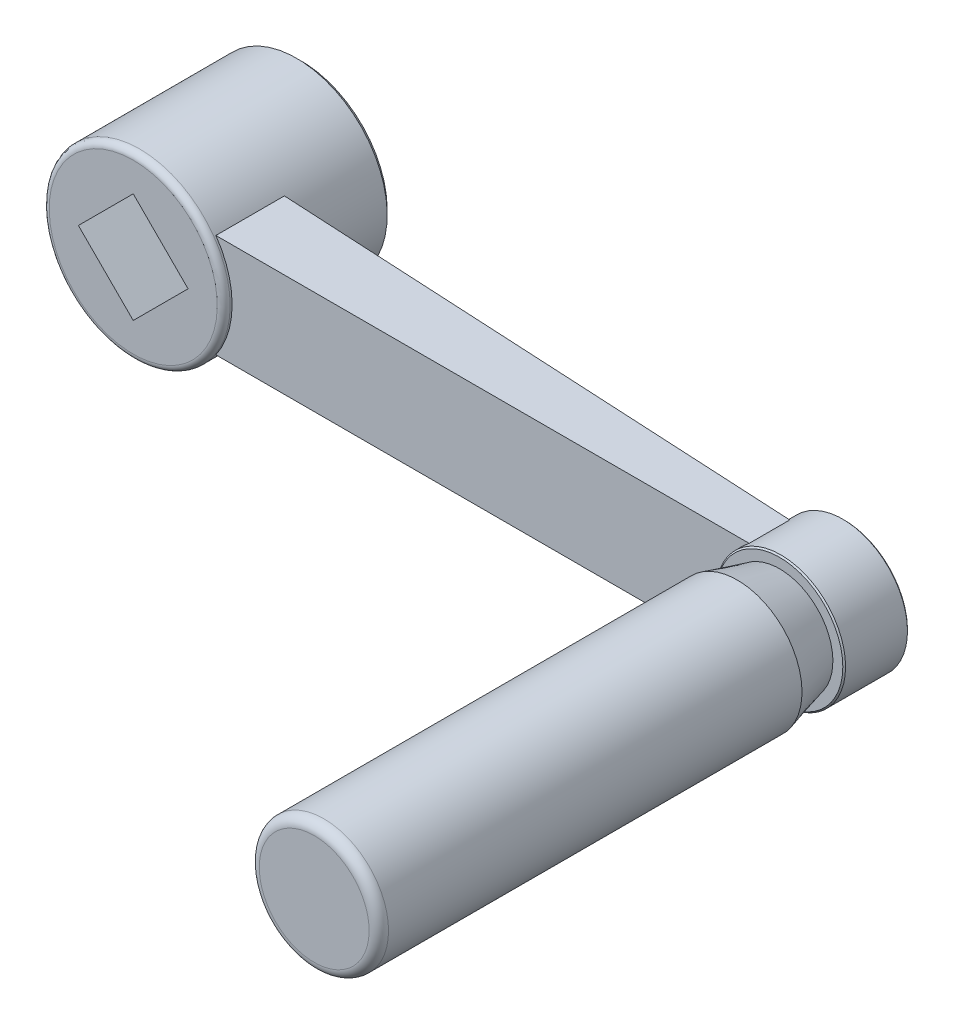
ISO-10303-21;
HEADER;
FILE_DESCRIPTION(('STEP AP214'),'2;1');
FILE_NAME('part.step','',(''),(''),'','','');
FILE_SCHEMA(('AUTOMOTIVE_DESIGN { 1 0 10303 214 1 1 1 1 }'));
ENDSEC;
DATA;
#1=APPLICATION_CONTEXT('core data for automotive mechanical design processes');
#2=APPLICATION_PROTOCOL_DEFINITION('international standard','automotive_design',2000,#1);
#3=PRODUCT_CONTEXT('',#1,'mechanical');
#4=PRODUCT('Part','Part','',(#3));
#5=PRODUCT_RELATED_PRODUCT_CATEGORY('part','',(#4));
#6=PRODUCT_DEFINITION_FORMATION('','',#4);
#7=PRODUCT_DEFINITION_CONTEXT('part definition',#1,'design');
#8=PRODUCT_DEFINITION('design','',#6,#7);
#9=PRODUCT_DEFINITION_SHAPE('','',#8);
#10=(LENGTH_UNIT() NAMED_UNIT(*) SI_UNIT(.MILLI.,.METRE.));
#11=(NAMED_UNIT(*) PLANE_ANGLE_UNIT() SI_UNIT($,.RADIAN.));
#12=(NAMED_UNIT(*) SI_UNIT($,.STERADIAN.) SOLID_ANGLE_UNIT());
#13=UNCERTAINTY_MEASURE_WITH_UNIT(LENGTH_MEASURE(1.E-05),#10,'distance_accuracy_value','');
#14=(GEOMETRIC_REPRESENTATION_CONTEXT(3) GLOBAL_UNCERTAINTY_ASSIGNED_CONTEXT((#13)) GLOBAL_UNIT_ASSIGNED_CONTEXT((#10,
#11,#12)) REPRESENTATION_CONTEXT('',''));
#15=CARTESIAN_POINT('',(0.,0.,0.));
#16=DIRECTION('',(0.,0.,1.));
#17=DIRECTION('',(1.,0.,0.));
#18=AXIS2_PLACEMENT_3D('',#15,#16,#17);
#19=CARTESIAN_POINT('',(102.3865,0.,17.));
#20=DIRECTION('',(0.,0.,1.));
#21=DIRECTION('',(0.,-1.,0.));
#22=AXIS2_PLACEMENT_3D('',#19,#20,#21);
#23=PLANE('',#22);
#24=CARTESIAN_POINT('',(100.,0.,17.0000000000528));
#25=DIRECTION('',(0.,0.,1.));
#26=DIRECTION('',(0.,-1.,0.));
#27=AXIS2_PLACEMENT_3D('',#24,#25,#26);
#28=CIRCLE('',#27,2.38650000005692);
#29=CARTESIAN_POINT('',(100.,-2.38650000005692,17.0000000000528));
#30=VERTEX_POINT('',#29);
#31=EDGE_CURVE('E17',#30,#30,#28,.T.);
#32=ORIENTED_EDGE('',*,*,#31,.F.);
#33=EDGE_LOOP('',(#32));
#34=FACE_BOUND('',#33,.T.);
#35=ADVANCED_FACE('F14',(#34),#23,.F.);
#36=CARTESIAN_POINT('',(100.,0.,17.0719999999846));
#37=DIRECTION('',(0.,0.,1.));
#38=DIRECTION('',(0.,-1.,0.));
#39=AXIS2_PLACEMENT_3D('',#36,#37,#38);
#40=CONICAL_SURFACE('',#39,2.45849999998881,0.785398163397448);
#41=CARTESIAN_POINT('',(100.,0.,17.072));
#42=DIRECTION('',(0.,0.,1.));
#43=DIRECTION('',(0.,-1.,0.));
#44=AXIS2_PLACEMENT_3D('',#41,#42,#43);
#45=CIRCLE('',#44,2.4585);
#46=CARTESIAN_POINT('',(100.,-2.4585,17.072));
#47=VERTEX_POINT('',#46);
#48=EDGE_CURVE('E98',#47,#47,#45,.F.);
#49=ORIENTED_EDGE('',*,*,#48,.T.);
#50=EDGE_LOOP('',(#49));
#51=FACE_BOUND('',#50,.T.);
#52=ORIENTED_EDGE('',*,*,#31,.T.);
#53=EDGE_LOOP('',(#52));
#54=FACE_BOUND('',#53,.T.);
#55=ADVANCED_FACE('F210',(#51,#54),#40,.T.);
#56=CARTESIAN_POINT('',(-8.48528137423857,0.,26.));
#57=DIRECTION('',(0.707106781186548,0.707106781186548,0.));
#58=DIRECTION('',(-0.707106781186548,0.707106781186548,0.));
#59=AXIS2_PLACEMENT_3D('',#56,#57,#58);
#60=PLANE('',#59);
#61=DIRECTION('',(0.707106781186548,-0.707106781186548,0.));
#62=VECTOR('',#61,1.);
#63=CARTESIAN_POINT('',(-8.48528137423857,0.,26.));
#64=LINE('',#63,#62);
#65=CARTESIAN_POINT('',(-8.48528137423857,0.,26.));
#66=VERTEX_POINT('',#65);
#67=CARTESIAN_POINT('',(0.,-8.48528137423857,26.));
#68=VERTEX_POINT('',#67);
#69=EDGE_CURVE('E310',#66,#68,#64,.T.);
#70=ORIENTED_EDGE('',*,*,#69,.T.);
#71=DIRECTION('',(0.,0.,1.));
#72=VECTOR('',#71,1.);
#73=CARTESIAN_POINT('',(0.,-8.48528137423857,26.));
#74=LINE('',#73,#72);
#75=CARTESIAN_POINT('',(0.,-8.48528137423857,0.));
#76=VERTEX_POINT('',#75);
#77=EDGE_CURVE('E92',#76,#68,#74,.T.);
#78=ORIENTED_EDGE('',*,*,#77,.F.);
#79=DIRECTION('',(-0.707106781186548,0.707106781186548,0.));
#80=VECTOR('',#79,1.);
#81=CARTESIAN_POINT('',(0.,-8.48528137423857,0.));
#82=LINE('',#81,#80);
#83=CARTESIAN_POINT('',(-8.48528137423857,0.,0.));
#84=VERTEX_POINT('',#83);
#85=EDGE_CURVE('E86',#76,#84,#82,.T.);
#86=ORIENTED_EDGE('',*,*,#85,.T.);
#87=DIRECTION('',(0.,0.,1.));
#88=VECTOR('',#87,1.);
#89=CARTESIAN_POINT('',(-8.48528137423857,0.,26.));
#90=LINE('',#89,#88);
#91=EDGE_CURVE('E89',#66,#84,#90,.F.);
#92=ORIENTED_EDGE('',*,*,#91,.F.);
#93=EDGE_LOOP('',(#70,#78,#86,#92));
#94=FACE_BOUND('',#93,.T.);
#95=ADVANCED_FACE('F88',(#94),#60,.T.);
#96=CARTESIAN_POINT('',(0.,-8.48528137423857,26.));
#97=DIRECTION('',(-0.707106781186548,0.707106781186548,0.));
#98=DIRECTION('',(-0.707106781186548,-0.707106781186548,0.));
#99=AXIS2_PLACEMENT_3D('',#96,#97,#98);
#100=PLANE('',#99);
#101=DIRECTION('',(0.707106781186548,0.707106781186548,0.));
#102=VECTOR('',#101,1.);
#103=CARTESIAN_POINT('',(0.,-8.48528137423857,26.));
#104=LINE('',#103,#102);
#105=CARTESIAN_POINT('',(8.48528137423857,0.,26.));
#106=VERTEX_POINT('',#105);
#107=EDGE_CURVE('E311',#68,#106,#104,.T.);
#108=ORIENTED_EDGE('',*,*,#107,.T.);
#109=DIRECTION('',(0.,0.,1.));
#110=VECTOR('',#109,1.);
#111=CARTESIAN_POINT('',(8.48528137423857,0.,26.));
#112=LINE('',#111,#110);
#113=CARTESIAN_POINT('',(8.48528137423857,0.,0.));
#114=VERTEX_POINT('',#113);
#115=EDGE_CURVE('E122',#114,#106,#112,.T.);
#116=ORIENTED_EDGE('',*,*,#115,.F.);
#117=DIRECTION('',(-0.707106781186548,-0.707106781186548,0.));
#118=VECTOR('',#117,1.);
#119=CARTESIAN_POINT('',(8.48528137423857,0.,0.));
#120=LINE('',#119,#118);
#121=EDGE_CURVE('E113',#114,#76,#120,.T.);
#122=ORIENTED_EDGE('',*,*,#121,.T.);
#123=ORIENTED_EDGE('',*,*,#77,.T.);
#124=EDGE_LOOP('',(#108,#116,#122,#123));
#125=FACE_BOUND('',#124,.T.);
#126=ADVANCED_FACE('F205',(#125),#100,.T.);
#127=CARTESIAN_POINT('',(8.48528137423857,0.,26.));
#128=DIRECTION('',(-0.707106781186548,-0.707106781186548,0.));
#129=DIRECTION('',(0.707106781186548,-0.707106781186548,0.));
#130=AXIS2_PLACEMENT_3D('',#127,#128,#129);
#131=PLANE('',#130);
#132=DIRECTION('',(-0.707106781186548,0.707106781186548,0.));
#133=VECTOR('',#132,1.);
#134=CARTESIAN_POINT('',(8.48528137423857,0.,26.));
#135=LINE('',#134,#133);
#136=CARTESIAN_POINT('',(0.,8.48528137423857,26.));
#137=VERTEX_POINT('',#136);
#138=EDGE_CURVE('E64',#106,#137,#135,.T.);
#139=ORIENTED_EDGE('',*,*,#138,.T.);
#140=DIRECTION('',(0.,0.,1.));
#141=VECTOR('',#140,1.);
#142=CARTESIAN_POINT('',(0.,8.48528137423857,26.));
#143=LINE('',#142,#141);
#144=CARTESIAN_POINT('',(0.,8.48528137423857,0.));
#145=VERTEX_POINT('',#144);
#146=EDGE_CURVE('E107',#145,#137,#143,.T.);
#147=ORIENTED_EDGE('',*,*,#146,.F.);
#148=DIRECTION('',(0.707106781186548,-0.707106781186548,0.));
#149=VECTOR('',#148,1.);
#150=CARTESIAN_POINT('',(0.,8.48528137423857,0.));
#151=LINE('',#150,#149);
#152=EDGE_CURVE('E111',#145,#114,#151,.T.);
#153=ORIENTED_EDGE('',*,*,#152,.T.);
#154=ORIENTED_EDGE('',*,*,#115,.T.);
#155=EDGE_LOOP('',(#139,#147,#153,#154));
#156=FACE_BOUND('',#155,.T.);
#157=ADVANCED_FACE('F202',(#156),#131,.T.);
#158=CARTESIAN_POINT('',(0.,8.48528137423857,26.));
#159=DIRECTION('',(0.707106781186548,-0.707106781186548,0.));
#160=DIRECTION('',(0.707106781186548,0.707106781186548,0.));
#161=AXIS2_PLACEMENT_3D('',#158,#159,#160);
#162=PLANE('',#161);
#163=DIRECTION('',(-0.707106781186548,-0.707106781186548,0.));
#164=VECTOR('',#163,1.);
#165=CARTESIAN_POINT('',(0.,8.48528137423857,26.));
#166=LINE('',#165,#164);
#167=EDGE_CURVE('E105',#137,#66,#166,.T.);
#168=ORIENTED_EDGE('',*,*,#167,.T.);
#169=ORIENTED_EDGE('',*,*,#91,.T.);
#170=DIRECTION('',(0.707106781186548,0.707106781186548,0.));
#171=VECTOR('',#170,1.);
#172=CARTESIAN_POINT('',(-8.48528137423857,0.,0.));
#173=LINE('',#172,#171);
#174=EDGE_CURVE('E97',#84,#145,#173,.T.);
#175=ORIENTED_EDGE('',*,*,#174,.T.);
#176=ORIENTED_EDGE('',*,*,#146,.T.);
#177=EDGE_LOOP('',(#168,#169,#175,#176));
#178=FACE_BOUND('',#177,.T.);
#179=ADVANCED_FACE('F102',(#178),#162,.T.);
#180=CARTESIAN_POINT('',(100.,0.,16.));
#181=DIRECTION('',(0.,0.,1.));
#182=DIRECTION('',(0.,-1.,0.));
#183=AXIS2_PLACEMENT_3D('',#180,#181,#182);
#184=CYLINDRICAL_SURFACE('',#183,2.4585);
#185=ORIENTED_EDGE('',*,*,#48,.F.);
#186=EDGE_LOOP('',(#185));
#187=FACE_BOUND('',#186,.T.);
#188=CARTESIAN_POINT('',(100.,0.,16.5415000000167));
#189=DIRECTION('',(0.,0.,-1.));
#190=DIRECTION('',(0.,1.,0.));
#191=AXIS2_PLACEMENT_3D('',#188,#189,#190);
#192=CIRCLE('',#191,2.45849999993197);
#193=CARTESIAN_POINT('',(100.,2.45849999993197,16.5415000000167));
#194=VERTEX_POINT('',#193);
#195=EDGE_CURVE('E158',#194,#194,#192,.T.);
#196=ORIENTED_EDGE('',*,*,#195,.T.);
#197=EDGE_LOOP('',(#196));
#198=FACE_BOUND('',#197,.T.);
#199=ADVANCED_FACE('F195',(#187,#198),#184,.F.);
#200=CARTESIAN_POINT('',(13.2928932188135,0.,0.));
#201=DIRECTION('',(0.,0.,1.));
#202=DIRECTION('',(0.,-1.,0.));
#203=AXIS2_PLACEMENT_3D('',#200,#201,#202);
#204=PLANE('',#203);
#205=CARTESIAN_POINT('',(0.,0.,0.));
#206=DIRECTION('',(0.,0.,1.));
#207=DIRECTION('',(0.,-1.,0.));
#208=AXIS2_PLACEMENT_3D('',#205,#206,#207);
#209=CIRCLE('',#208,13.2928932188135);
#210=CARTESIAN_POINT('',(0.,-13.2928932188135,0.));
#211=VERTEX_POINT('',#210);
#212=EDGE_CURVE('E156',#211,#211,#209,.T.);
#213=ORIENTED_EDGE('',*,*,#212,.F.);
#214=EDGE_LOOP('',(#213));
#215=FACE_BOUND('',#214,.T.);
#216=ORIENTED_EDGE('',*,*,#152,.F.);
#217=ORIENTED_EDGE('',*,*,#174,.F.);
#218=ORIENTED_EDGE('',*,*,#85,.F.);
#219=ORIENTED_EDGE('',*,*,#121,.F.);
#220=EDGE_LOOP('',(#216,#217,#218,#219));
#221=FACE_BOUND('',#220,.T.);
#222=ADVANCED_FACE('F109',(#215,#221),#204,.F.);
#223=CARTESIAN_POINT('',(0.,0.,26.));
#224=DIRECTION('',(0.,0.,-1.));
#225=DIRECTION('',(0.,1.,0.));
#226=AXIS2_PLACEMENT_3D('',#223,#224,#225);
#227=PLANE('',#226);
#228=ORIENTED_EDGE('',*,*,#138,.F.);
#229=ORIENTED_EDGE('',*,*,#107,.F.);
#230=ORIENTED_EDGE('',*,*,#69,.F.);
#231=ORIENTED_EDGE('',*,*,#167,.F.);
#232=EDGE_LOOP('',(#228,#229,#230,#231));
#233=FACE_BOUND('',#232,.T.);
#234=CARTESIAN_POINT('',(0.,0.,26.));
#235=DIRECTION('',(0.,0.,-1.));
#236=DIRECTION('',(0.,1.,0.));
#237=AXIS2_PLACEMENT_3D('',#234,#235,#236);
#238=CIRCLE('',#237,13.);
#239=CARTESIAN_POINT('',(0.,13.,26.));
#240=VERTEX_POINT('',#239);
#241=EDGE_CURVE('E155',#240,#240,#238,.T.);
#242=ORIENTED_EDGE('',*,*,#241,.F.);
#243=EDGE_LOOP('',(#242));
#244=FACE_BOUND('',#243,.T.);
#245=ADVANCED_FACE('F180',(#233,#244),#227,.F.);
#246=CARTESIAN_POINT('',(100.,0.,16.0000000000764));
#247=DIRECTION('',(0.,0.,-1.));
#248=DIRECTION('',(0.,1.,0.));
#249=AXIS2_PLACEMENT_3D('',#246,#247,#248);
#250=CONICAL_SURFACE('',#249,2.99999999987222,0.785398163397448);
#251=ORIENTED_EDGE('',*,*,#195,.F.);
#252=EDGE_LOOP('',(#251));
#253=FACE_BOUND('',#252,.T.);
#254=CARTESIAN_POINT('',(100.,0.,16.0000000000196));
#255=DIRECTION('',(0.,0.,-1.));
#256=DIRECTION('',(0.,1.,0.));
#257=AXIS2_PLACEMENT_3D('',#254,#255,#256);
#258=CIRCLE('',#257,2.99999999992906);
#259=CARTESIAN_POINT('',(100.,2.99999999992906,16.0000000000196));
#260=VERTEX_POINT('',#259);
#261=EDGE_CURVE('E152',#260,#260,#258,.F.);
#262=ORIENTED_EDGE('',*,*,#261,.F.);
#263=EDGE_LOOP('',(#262));
#264=FACE_BOUND('',#263,.T.);
#265=ADVANCED_FACE('F190',(#253,#264),#250,.F.);
#266=CARTESIAN_POINT('',(0.,0.,0.707106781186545));
#267=DIRECTION('',(0.,0.,1.));
#268=DIRECTION('',(0.,-1.,0.));
#269=AXIS2_PLACEMENT_3D('',#266,#267,#268);
#270=CONICAL_SURFACE('',#269,14.,0.78539816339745);
#271=CARTESIAN_POINT('',(0.,0.,0.707106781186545));
#272=DIRECTION('',(0.,0.,1.));
#273=DIRECTION('',(0.,-1.,0.));
#274=AXIS2_PLACEMENT_3D('',#271,#272,#273);
#275=CIRCLE('',#274,14.);
#276=CARTESIAN_POINT('',(0.,-14.,0.707106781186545));
#277=VERTEX_POINT('',#276);
#278=EDGE_CURVE('E154',#277,#277,#275,.T.);
#279=ORIENTED_EDGE('',*,*,#278,.F.);
#280=EDGE_LOOP('',(#279));
#281=FACE_BOUND('',#280,.T.);
#282=ORIENTED_EDGE('',*,*,#212,.T.);
#283=EDGE_LOOP('',(#282));
#284=FACE_BOUND('',#283,.T.);
#285=ADVANCED_FACE('F298',(#281,#284),#270,.T.);
#286=CARTESIAN_POINT('',(0.,0.,25.));
#287=DIRECTION('',(0.,0.,-1.));
#288=DIRECTION('',(0.,1.,0.));
#289=AXIS2_PLACEMENT_3D('',#286,#287,#288);
#290=TOROIDAL_SURFACE('',#289,13.,1.);
#291=CARTESIAN_POINT('',(0.,0.,25.));
#292=DIRECTION('',(0.,0.,1.));
#293=DIRECTION('',(0.,-1.,0.));
#294=AXIS2_PLACEMENT_3D('',#291,#292,#293);
#295=CIRCLE('',#294,14.);
#296=CARTESIAN_POINT('',(0.,-14.,25.));
#297=VERTEX_POINT('',#296);
#298=EDGE_CURVE('E151',#297,#297,#295,.F.);
#299=ORIENTED_EDGE('',*,*,#298,.F.);
#300=EDGE_LOOP('',(#299));
#301=FACE_BOUND('',#300,.T.);
#302=ORIENTED_EDGE('',*,*,#241,.T.);
#303=EDGE_LOOP('',(#302));
#304=FACE_BOUND('',#303,.T.);
#305=ADVANCED_FACE('F294',(#301,#304),#290,.T.);
#306=CARTESIAN_POINT('',(103.,0.,16.));
#307=DIRECTION('',(0.,0.,-1.));
#308=DIRECTION('',(0.,1.,0.));
#309=AXIS2_PLACEMENT_3D('',#306,#307,#308);
#310=PLANE('',#309);
#311=ORIENTED_EDGE('',*,*,#261,.T.);
#312=EDGE_LOOP('',(#311));
#313=FACE_BOUND('',#312,.T.);
#314=CARTESIAN_POINT('',(100.,0.,16.));
#315=DIRECTION('',(0.,0.,1.));
#316=DIRECTION('',(0.,-1.,0.));
#317=AXIS2_PLACEMENT_3D('',#314,#315,#316);
#318=CIRCLE('',#317,9.78786796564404);
#319=CARTESIAN_POINT('',(100.,-9.78786796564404,16.));
#320=VERTEX_POINT('',#319);
#321=EDGE_CURVE('E148',#320,#320,#318,.T.);
#322=ORIENTED_EDGE('',*,*,#321,.F.);
#323=EDGE_LOOP('',(#322));
#324=FACE_BOUND('',#323,.T.);
#325=ADVANCED_FACE('F290',(#313,#324),#310,.T.);
#326=CARTESIAN_POINT('',(0.,0.,0.));
#327=DIRECTION('',(0.,0.,1.));
#328=DIRECTION('',(0.,-1.,0.));
#329=AXIS2_PLACEMENT_3D('',#326,#327,#328);
#330=CYLINDRICAL_SURFACE('',#329,14.);
#331=ORIENTED_EDGE('',*,*,#298,.T.);
#332=EDGE_LOOP('',(#331));
#333=FACE_BOUND('',#332,.T.);
#334=CARTESIAN_POINT('',(0.,0.,13.5));
#335=DIRECTION('',(-0.0523359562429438,0.,0.998629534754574));
#336=DIRECTION('',(0.998629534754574,0.,0.0523359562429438));
#337=AXIS2_PLACEMENT_3D('',#334,#335,#336);
#338=ELLIPSE('',#337,14.0192128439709,14.);
#339=CARTESIAN_POINT('',(11.4891252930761,8.,14.1021195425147));
#340=VERTEX_POINT('',#339);
#341=CARTESIAN_POINT('',(11.4891252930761,-8.,14.1021195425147));
#342=VERTEX_POINT('',#341);
#343=EDGE_CURVE('E55',#340,#342,#338,.F.);
#344=ORIENTED_EDGE('',*,*,#343,.T.);
#345=DIRECTION('',(0.,0.,1.));
#346=VECTOR('',#345,1.);
#347=CARTESIAN_POINT('',(11.4891252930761,-8.,0.));
#348=LINE('',#347,#346);
#349=CARTESIAN_POINT('',(11.4891252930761,-8.,24.7));
#350=VERTEX_POINT('',#349);
#351=EDGE_CURVE('E339',#342,#350,#348,.T.);
#352=ORIENTED_EDGE('',*,*,#351,.T.);
#353=CARTESIAN_POINT('',(0.,0.,24.7));
#354=DIRECTION('',(0.,0.,1.));
#355=DIRECTION('',(0.,-1.,0.));
#356=AXIS2_PLACEMENT_3D('',#353,#354,#355);
#357=CIRCLE('',#356,14.);
#358=CARTESIAN_POINT('',(11.4891252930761,8.,24.7));
#359=VERTEX_POINT('',#358);
#360=EDGE_CURVE('E142',#350,#359,#357,.T.);
#361=ORIENTED_EDGE('',*,*,#360,.T.);
#362=DIRECTION('',(0.,0.,1.));
#363=VECTOR('',#362,1.);
#364=CARTESIAN_POINT('',(11.4891252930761,8.,0.));
#365=LINE('',#364,#363);
#366=EDGE_CURVE('E145',#340,#359,#365,.T.);
#367=ORIENTED_EDGE('',*,*,#366,.F.);
#368=EDGE_LOOP('',(#344,#352,#361,#367));
#369=FACE_BOUND('',#368,.T.);
#370=ORIENTED_EDGE('',*,*,#278,.T.);
#371=EDGE_LOOP('',(#370));
#372=FACE_BOUND('',#371,.T.);
#373=ADVANCED_FACE('F286',(#333,#369,#372),#330,.T.);
#374=CARTESIAN_POINT('',(100.,0.,16.212132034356));
#375=DIRECTION('',(0.,0.,1.));
#376=DIRECTION('',(0.,-1.,0.));
#377=AXIS2_PLACEMENT_3D('',#374,#375,#376);
#378=CONICAL_SURFACE('',#377,10.,0.785398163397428);
#379=ORIENTED_EDGE('',*,*,#321,.T.);
#380=EDGE_LOOP('',(#379));
#381=FACE_BOUND('',#380,.T.);
#382=CARTESIAN_POINT('',(100.,0.,16.212132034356));
#383=DIRECTION('',(0.,0.,1.));
#384=DIRECTION('',(0.,-1.,0.));
#385=AXIS2_PLACEMENT_3D('',#382,#383,#384);
#386=CIRCLE('',#385,10.);
#387=CARTESIAN_POINT('',(100.,-10.,16.212132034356));
#388=VERTEX_POINT('',#387);
#389=EDGE_CURVE('E141',#388,#388,#386,.T.);
#390=ORIENTED_EDGE('',*,*,#389,.F.);
#391=EDGE_LOOP('',(#390));
#392=FACE_BOUND('',#391,.T.);
#393=ADVANCED_FACE('F283',(#381,#392),#378,.T.);
#394=CARTESIAN_POINT('',(0.,-8.,13.5));
#395=DIRECTION('',(-0.0523359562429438,0.,0.998629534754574));
#396=DIRECTION('',(-0.998629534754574,0.,-0.0523359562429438));
#397=AXIS2_PLACEMENT_3D('',#394,#395,#396);
#398=PLANE('',#397);
#399=CARTESIAN_POINT('',(100.,0.,18.7407779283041));
#400=DIRECTION('',(-0.0523359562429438,0.,0.998629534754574));
#401=DIRECTION('',(0.998629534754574,0.,0.0523359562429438));
#402=AXIS2_PLACEMENT_3D('',#399,#400,#401);
#403=ELLIPSE('',#402,10.0137234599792,10.);
#404=CARTESIAN_POINT('',(94.,-8.,18.4263312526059));
#405=VERTEX_POINT('',#404);
#406=CARTESIAN_POINT('',(94.,8.,18.4263312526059));
#407=VERTEX_POINT('',#406);
#408=EDGE_CURVE('E138',#405,#407,#403,.F.);
#409=ORIENTED_EDGE('',*,*,#408,.F.);
#410=DIRECTION('',(-0.998629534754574,0.,-0.0523359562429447));
#411=VECTOR('',#410,1.);
#412=CARTESIAN_POINT('',(94.,-8.,18.4263312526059));
#413=LINE('',#412,#411);
#414=EDGE_CURVE('E342',#405,#342,#413,.T.);
#415=ORIENTED_EDGE('',*,*,#414,.T.);
#416=ORIENTED_EDGE('',*,*,#343,.F.);
#417=DIRECTION('',(-0.998629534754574,0.,-0.0523359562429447));
#418=VECTOR('',#417,1.);
#419=CARTESIAN_POINT('',(94.,8.,18.4263312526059));
#420=LINE('',#419,#418);
#421=EDGE_CURVE('E147',#407,#340,#420,.T.);
#422=ORIENTED_EDGE('',*,*,#421,.F.);
#423=EDGE_LOOP('',(#409,#415,#416,#422));
#424=FACE_BOUND('',#423,.T.);
#425=ADVANCED_FACE('F279',(#424),#398,.F.);
#426=CARTESIAN_POINT('',(0.,8.,0.));
#427=DIRECTION('',(0.,1.,0.));
#428=DIRECTION('',(-1.,0.,0.));
#429=AXIS2_PLACEMENT_3D('',#426,#427,#428);
#430=PLANE('',#429);
#431=ORIENTED_EDGE('',*,*,#366,.T.);
#432=DIRECTION('',(1.,0.,0.));
#433=VECTOR('',#432,1.);
#434=CARTESIAN_POINT('',(96.,8.,24.7));
#435=LINE('',#434,#433);
#436=CARTESIAN_POINT('',(94.,8.,24.7));
#437=VERTEX_POINT('',#436);
#438=EDGE_CURVE('E144',#359,#437,#435,.T.);
#439=ORIENTED_EDGE('',*,*,#438,.T.);
#440=DIRECTION('',(0.,0.,1.));
#441=VECTOR('',#440,1.);
#442=CARTESIAN_POINT('',(94.,8.,16.));
#443=LINE('',#442,#441);
#444=EDGE_CURVE('E137',#407,#437,#443,.T.);
#445=ORIENTED_EDGE('',*,*,#444,.F.);
#446=ORIENTED_EDGE('',*,*,#421,.T.);
#447=EDGE_LOOP('',(#431,#439,#445,#446));
#448=FACE_BOUND('',#447,.T.);
#449=ADVANCED_FACE('F276',(#448),#430,.T.);
#450=CARTESIAN_POINT('',(96.,-8.,24.7));
#451=DIRECTION('',(0.,0.,-1.));
#452=DIRECTION('',(0.,1.,0.));
#453=AXIS2_PLACEMENT_3D('',#450,#451,#452);
#454=PLANE('',#453);
#455=CARTESIAN_POINT('',(100.,0.,24.7));
#456=DIRECTION('',(0.,0.,1.));
#457=DIRECTION('',(0.,-1.,0.));
#458=AXIS2_PLACEMENT_3D('',#455,#456,#457);
#459=CIRCLE('',#458,10.);
#460=CARTESIAN_POINT('',(94.,-8.,24.7));
#461=VERTEX_POINT('',#460);
#462=EDGE_CURVE('E133',#437,#461,#459,.T.);
#463=ORIENTED_EDGE('',*,*,#462,.F.);
#464=ORIENTED_EDGE('',*,*,#438,.F.);
#465=ORIENTED_EDGE('',*,*,#360,.F.);
#466=DIRECTION('',(-1.,0.,0.));
#467=VECTOR('',#466,1.);
#468=CARTESIAN_POINT('',(0.,-8.,24.7));
#469=LINE('',#468,#467);
#470=EDGE_CURVE('E32',#350,#461,#469,.F.);
#471=ORIENTED_EDGE('',*,*,#470,.T.);
#472=EDGE_LOOP('',(#463,#464,#465,#471));
#473=FACE_BOUND('',#472,.T.);
#474=ADVANCED_FACE('F272',(#473),#454,.F.);
#475=CARTESIAN_POINT('',(0.,-8.,0.));
#476=DIRECTION('',(0.,1.,0.));
#477=DIRECTION('',(-1.,0.,0.));
#478=AXIS2_PLACEMENT_3D('',#475,#476,#477);
#479=PLANE('',#478);
#480=DIRECTION('',(0.,0.,1.));
#481=VECTOR('',#480,1.);
#482=CARTESIAN_POINT('',(94.,-8.,16.));
#483=LINE('',#482,#481);
#484=EDGE_CURVE('E136',#461,#405,#483,.F.);
#485=ORIENTED_EDGE('',*,*,#484,.F.);
#486=ORIENTED_EDGE('',*,*,#470,.F.);
#487=ORIENTED_EDGE('',*,*,#351,.F.);
#488=ORIENTED_EDGE('',*,*,#414,.F.);
#489=EDGE_LOOP('',(#485,#486,#487,#488));
#490=FACE_BOUND('',#489,.T.);
#491=ADVANCED_FACE('F268',(#490),#479,.F.);
#492=CARTESIAN_POINT('',(100.,0.,16.));
#493=DIRECTION('',(0.,0.,1.));
#494=DIRECTION('',(0.,-1.,0.));
#495=AXIS2_PLACEMENT_3D('',#492,#493,#494);
#496=CYLINDRICAL_SURFACE('',#495,10.);
#497=ORIENTED_EDGE('',*,*,#462,.T.);
#498=ORIENTED_EDGE('',*,*,#484,.T.);
#499=ORIENTED_EDGE('',*,*,#408,.T.);
#500=ORIENTED_EDGE('',*,*,#444,.T.);
#501=EDGE_LOOP('',(#497,#498,#499,#500));
#502=FACE_BOUND('',#501,.T.);
#503=ORIENTED_EDGE('',*,*,#389,.T.);
#504=EDGE_LOOP('',(#503));
#505=FACE_BOUND('',#504,.T.);
#506=CARTESIAN_POINT('',(100.,0.,25.787867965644));
#507=DIRECTION('',(0.,0.,-1.));
#508=DIRECTION('',(0.,1.,0.));
#509=AXIS2_PLACEMENT_3D('',#506,#507,#508);
#510=CIRCLE('',#509,10.);
#511=CARTESIAN_POINT('',(100.,10.,25.787867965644));
#512=VERTEX_POINT('',#511);
#513=EDGE_CURVE('E132',#512,#512,#510,.F.);
#514=ORIENTED_EDGE('',*,*,#513,.F.);
#515=EDGE_LOOP('',(#514));
#516=FACE_BOUND('',#515,.T.);
#517=ADVANCED_FACE('F264',(#502,#505,#516),#496,.T.);
#518=CARTESIAN_POINT('',(100.,0.,25.787867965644));
#519=DIRECTION('',(0.,0.,-1.));
#520=DIRECTION('',(1.,0.,0.));
#521=AXIS2_PLACEMENT_3D('',#518,#519,#520);
#522=CONICAL_SURFACE('',#521,10.,0.785398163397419);
#523=ORIENTED_EDGE('',*,*,#513,.T.);
#524=EDGE_LOOP('',(#523));
#525=FACE_BOUND('',#524,.T.);
#526=CARTESIAN_POINT('',(100.,0.,26.));
#527=DIRECTION('',(0.,0.,-1.));
#528=DIRECTION('',(1.,0.,0.));
#529=AXIS2_PLACEMENT_3D('',#526,#527,#528);
#530=CIRCLE('',#529,9.78786796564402);
#531=CARTESIAN_POINT('',(109.787867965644,0.,26.));
#532=VERTEX_POINT('',#531);
#533=EDGE_CURVE('E129',#532,#532,#530,.F.);
#534=ORIENTED_EDGE('',*,*,#533,.F.);
#535=EDGE_LOOP('',(#534));
#536=FACE_BOUND('',#535,.T.);
#537=ADVANCED_FACE('F260',(#525,#536),#522,.T.);
#538=CARTESIAN_POINT('',(109.787867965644,0.,26.));
#539=DIRECTION('',(0.,0.,1.));
#540=DIRECTION('',(0.,-1.,0.));
#541=AXIS2_PLACEMENT_3D('',#538,#539,#540);
#542=PLANE('',#541);
#543=ORIENTED_EDGE('',*,*,#533,.T.);
#544=EDGE_LOOP('',(#543));
#545=FACE_BOUND('',#544,.T.);
#546=CARTESIAN_POINT('',(100.,0.,26.));
#547=DIRECTION('',(0.,0.,1.));
#548=DIRECTION('',(0.,-1.,0.));
#549=AXIS2_PLACEMENT_3D('',#546,#547,#548);
#550=CIRCLE('',#549,8.25);
#551=CARTESIAN_POINT('',(100.,-8.25,26.));
#552=VERTEX_POINT('',#551);
#553=EDGE_CURVE('E125',#552,#552,#550,.T.);
#554=ORIENTED_EDGE('',*,*,#553,.F.);
#555=EDGE_LOOP('',(#554));
#556=FACE_BOUND('',#555,.T.);
#557=ADVANCED_FACE('F257',(#545,#556),#542,.T.);
#558=CARTESIAN_POINT('',(100.,0.,98.));
#559=DIRECTION('',(0.,0.,-1.));
#560=DIRECTION('',(0.,1.,0.));
#561=AXIS2_PLACEMENT_3D('',#558,#559,#560);
#562=PLANE('',#561);
#563=CARTESIAN_POINT('',(100.,0.,98.));
#564=DIRECTION('',(0.,0.,-1.));
#565=DIRECTION('',(0.,1.,0.));
#566=AXIS2_PLACEMENT_3D('',#563,#564,#565);
#567=CIRCLE('',#566,8.50000000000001);
#568=CARTESIAN_POINT('',(100.,8.50000000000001,98.));
#569=VERTEX_POINT('',#568);
#570=EDGE_CURVE('E128',#569,#569,#567,.T.);
#571=ORIENTED_EDGE('',*,*,#570,.F.);
#572=EDGE_LOOP('',(#571));
#573=FACE_BOUND('',#572,.T.);
#574=ADVANCED_FACE('F248',(#573),#562,.F.);
#575=CARTESIAN_POINT('',(100.,0.,32.5310889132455));
#576=DIRECTION('',(0.,0.,1.));
#577=DIRECTION('',(0.,-1.,0.));
#578=AXIS2_PLACEMENT_3D('',#575,#576,#577);
#579=CONICAL_SURFACE('',#578,10.,0.26179938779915);
#580=CARTESIAN_POINT('',(100.,0.,32.5310889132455));
#581=DIRECTION('',(0.,0.,1.));
#582=DIRECTION('',(0.,-1.,0.));
#583=AXIS2_PLACEMENT_3D('',#580,#581,#582);
#584=CIRCLE('',#583,10.);
#585=CARTESIAN_POINT('',(100.,-10.,32.5310889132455));
#586=VERTEX_POINT('',#585);
#587=EDGE_CURVE('E23',#586,#586,#584,.T.);
#588=ORIENTED_EDGE('',*,*,#587,.F.);
#589=EDGE_LOOP('',(#588));
#590=FACE_BOUND('',#589,.T.);
#591=ORIENTED_EDGE('',*,*,#553,.T.);
#592=EDGE_LOOP('',(#591));
#593=FACE_BOUND('',#592,.T.);
#594=ADVANCED_FACE('F227',(#590,#593),#579,.T.);
#595=CARTESIAN_POINT('',(100.,0.,96.5));
#596=DIRECTION('',(0.,0.,-1.));
#597=DIRECTION('',(0.,1.,0.));
#598=AXIS2_PLACEMENT_3D('',#595,#596,#597);
#599=TOROIDAL_SURFACE('',#598,8.5,1.50000000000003);
#600=CARTESIAN_POINT('',(100.,0.,96.5));
#601=DIRECTION('',(0.,0.,1.));
#602=DIRECTION('',(0.,-1.,0.));
#603=AXIS2_PLACEMENT_3D('',#600,#601,#602);
#604=CIRCLE('',#603,10.);
#605=CARTESIAN_POINT('',(100.,-10.,96.5));
#606=VERTEX_POINT('',#605);
#607=EDGE_CURVE('E9',#606,#606,#604,.F.);
#608=ORIENTED_EDGE('',*,*,#607,.F.);
#609=EDGE_LOOP('',(#608));
#610=FACE_BOUND('',#609,.T.);
#611=ORIENTED_EDGE('',*,*,#570,.T.);
#612=EDGE_LOOP('',(#611));
#613=FACE_BOUND('',#612,.T.);
#614=ADVANCED_FACE('F221',(#610,#613),#599,.T.);
#615=CARTESIAN_POINT('',(100.,0.,17.));
#616=DIRECTION('',(0.,0.,1.));
#617=DIRECTION('',(0.,-1.,0.));
#618=AXIS2_PLACEMENT_3D('',#615,#616,#617);
#619=CYLINDRICAL_SURFACE('',#618,10.);
#620=ORIENTED_EDGE('',*,*,#607,.T.);
#621=EDGE_LOOP('',(#620));
#622=FACE_BOUND('',#621,.T.);
#623=ORIENTED_EDGE('',*,*,#587,.T.);
#624=EDGE_LOOP('',(#623));
#625=FACE_BOUND('',#624,.T.);
#626=ADVANCED_FACE('F219',(#622,#625),#619,.T.);
#627=CLOSED_SHELL('',(#35,#55,#95,#126,#157,#179,#199,#222,#245,#265,#285,#305,#325,#373,#393,
#425,#449,#474,#491,#517,#537,#557,#574,#594,#614,#626));
#628=MANIFOLD_SOLID_BREP('B1',#627);
#629=ADVANCED_BREP_SHAPE_REPRESENTATION('',(#18,#628),#14);
#630=SHAPE_DEFINITION_REPRESENTATION(#9,#629);
ENDSEC;
END-ISO-10303-21;
